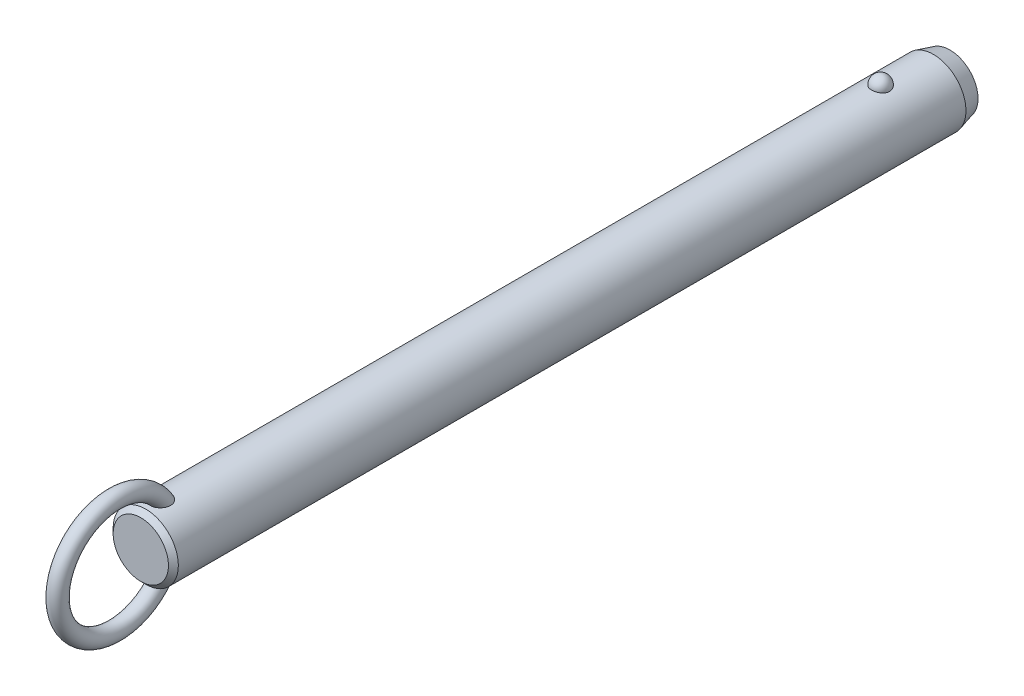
ISO-10303-21;
HEADER;
FILE_DESCRIPTION(('STEP AP214'),'2;1');
FILE_NAME('part.step','',(''),(''),'','','');
FILE_SCHEMA(('AUTOMOTIVE_DESIGN { 1 0 10303 214 1 1 1 1 }'));
ENDSEC;
DATA;
#1=APPLICATION_CONTEXT('core data for automotive mechanical design processes');
#2=APPLICATION_PROTOCOL_DEFINITION('international standard','automotive_design',2000,#1);
#3=PRODUCT_CONTEXT('',#1,'mechanical');
#4=PRODUCT('Part','Part','',(#3));
#5=PRODUCT_RELATED_PRODUCT_CATEGORY('part','',(#4));
#6=PRODUCT_DEFINITION_FORMATION('','',#4);
#7=PRODUCT_DEFINITION_CONTEXT('part definition',#1,'design');
#8=PRODUCT_DEFINITION('design','',#6,#7);
#9=PRODUCT_DEFINITION_SHAPE('','',#8);
#10=(LENGTH_UNIT() NAMED_UNIT(*) SI_UNIT(.MILLI.,.METRE.));
#11=(NAMED_UNIT(*) PLANE_ANGLE_UNIT() SI_UNIT($,.RADIAN.));
#12=(NAMED_UNIT(*) SI_UNIT($,.STERADIAN.) SOLID_ANGLE_UNIT());
#13=UNCERTAINTY_MEASURE_WITH_UNIT(LENGTH_MEASURE(1.E-05),#10,'distance_accuracy_value','');
#14=(GEOMETRIC_REPRESENTATION_CONTEXT(3) GLOBAL_UNCERTAINTY_ASSIGNED_CONTEXT((#13)) GLOBAL_UNIT_ASSIGNED_CONTEXT((#10,
#11,#12)) REPRESENTATION_CONTEXT('',''));
#15=CARTESIAN_POINT('',(0.,0.,0.));
#16=DIRECTION('',(0.,0.,1.));
#17=DIRECTION('',(1.,0.,0.));
#18=AXIS2_PLACEMENT_3D('',#15,#16,#17);
#19=CARTESIAN_POINT('',(0.,0.,167.6));
#20=DIRECTION('',(0.,0.,-1.));
#21=DIRECTION('',(-1.,0.,0.));
#22=AXIS2_PLACEMENT_3D('',#19,#20,#21);
#23=CYLINDRICAL_SURFACE('',#22,7.9);
#24=CARTESIAN_POINT('',(2.1785689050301,7.59367088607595,-2.20000000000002));
#25=CARTESIAN_POINT('',(2.17856679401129,7.59367269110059,-2.07701843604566));
#26=CARTESIAN_POINT('',(2.16853481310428,7.59657145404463,-1.95401006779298));
#27=CARTESIAN_POINT('',(2.12864689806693,7.607843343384,-1.71147811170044));
#28=CARTESIAN_POINT('',(2.09878338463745,7.61621856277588,-1.5919558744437));
#29=CARTESIAN_POINT('',(2.0199931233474,7.63749180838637,-1.35985638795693));
#30=CARTESIAN_POINT('',(1.97107475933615,7.6503878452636,-1.24727610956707));
#31=CARTESIAN_POINT('',(1.85539377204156,7.67926115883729,-1.03213234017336));
#32=CARTESIAN_POINT('',(1.78863158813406,7.69523835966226,-0.929568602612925));
#33=CARTESIAN_POINT('',(1.63856494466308,7.7285848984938,-0.73678633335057));
#34=CARTESIAN_POINT('',(1.55518140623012,7.7459606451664,-0.646630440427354));
#35=CARTESIAN_POINT('',(1.37422937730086,7.78009978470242,-0.481747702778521));
#36=CARTESIAN_POINT('',(1.27666086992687,7.79686317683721,-0.407020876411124));
#37=CARTESIAN_POINT('',(1.07024728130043,7.82786153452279,-0.275278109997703));
#38=CARTESIAN_POINT('',(0.961434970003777,7.84210353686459,-0.218212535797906));
#39=CARTESIAN_POINT('',(0.735351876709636,7.86652194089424,-0.123146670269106));
#40=CARTESIAN_POINT('',(0.618082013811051,7.87669878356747,-0.0851443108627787));
#41=CARTESIAN_POINT('',(0.380637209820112,7.89170521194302,-0.0298158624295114));
#42=CARTESIAN_POINT('',(0.260550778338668,7.89662650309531,-0.0121347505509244));
#43=CARTESIAN_POINT('',(0.0190117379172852,7.90090003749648,0.00324379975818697));
#44=CARTESIAN_POINT('',(-0.102440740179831,7.90025280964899,0.000943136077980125));
#45=CARTESIAN_POINT('',(-0.341452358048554,7.89351056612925,-0.0233955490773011));
#46=CARTESIAN_POINT('',(-0.459042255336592,7.88749257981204,-0.0451545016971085));
#47=CARTESIAN_POINT('',(-0.688796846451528,7.87075812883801,-0.107408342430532));
#48=CARTESIAN_POINT('',(-0.800961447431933,7.86004158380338,-0.14790355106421));
#49=CARTESIAN_POINT('',(-1.01743634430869,7.83497131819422,-0.246799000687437));
#50=CARTESIAN_POINT('',(-1.12169791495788,7.82059709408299,-0.305300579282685));
#51=CARTESIAN_POINT('',(-1.31891765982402,7.78976470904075,-0.43854939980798));
#52=CARTESIAN_POINT('',(-1.41187469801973,7.77330633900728,-0.513298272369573));
#53=CARTESIAN_POINT('',(-1.58577142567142,7.73972434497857,-0.678622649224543));
#54=CARTESIAN_POINT('',(-1.66645140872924,7.72259402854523,-0.769470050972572));
#55=CARTESIAN_POINT('',(-1.81161503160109,7.68983776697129,-0.963538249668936));
#56=CARTESIAN_POINT('',(-1.87609753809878,7.6742119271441,-1.0667599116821));
#57=CARTESIAN_POINT('',(-1.98790138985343,7.6460202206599,-1.28401170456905));
#58=CARTESIAN_POINT('',(-2.03501994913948,7.63349104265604,-1.39815107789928));
#59=CARTESIAN_POINT('',(-2.10986724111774,7.6131449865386,-1.6330178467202));
#60=CARTESIAN_POINT('',(-2.1375965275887,7.60532797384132,-1.75374505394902));
#61=CARTESIAN_POINT('',(-2.17289256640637,7.5953195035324,-1.99782562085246));
#62=CARTESIAN_POINT('',(-2.18054294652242,7.59310471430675,-2.12116592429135));
#63=CARTESIAN_POINT('',(-2.17572919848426,7.59448538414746,-2.36741799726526));
#64=CARTESIAN_POINT('',(-2.1632656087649,7.59808068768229,-2.49032977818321));
#65=CARTESIAN_POINT('',(-2.11865035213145,7.61064035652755,-2.73161015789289));
#66=CARTESIAN_POINT('',(-2.08659579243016,7.61957823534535,-2.84999812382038));
#67=CARTESIAN_POINT('',(-2.00367799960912,7.64179982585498,-3.07955956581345));
#68=CARTESIAN_POINT('',(-1.9528140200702,7.65508371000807,-3.19073275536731));
#69=CARTESIAN_POINT('',(-1.83321113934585,7.68460381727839,-3.40337899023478));
#70=CARTESIAN_POINT('',(-1.76437735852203,7.70085556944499,-3.5047965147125));
#71=CARTESIAN_POINT('',(-1.61069526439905,7.73445734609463,-3.69446912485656));
#72=CARTESIAN_POINT('',(-1.52584634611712,7.75180741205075,-3.78272371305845));
#73=CARTESIAN_POINT('',(-1.34198059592,7.78574608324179,-3.94393987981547));
#74=CARTESIAN_POINT('',(-1.24291308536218,7.80233167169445,-4.01684434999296));
#75=CARTESIAN_POINT('',(-1.03352039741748,7.83281625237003,-4.14489386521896));
#76=CARTESIAN_POINT('',(-0.92319600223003,7.84671543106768,-4.20004014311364));
#77=CARTESIAN_POINT('',(-0.695822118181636,7.87011575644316,-4.29042017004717));
#78=CARTESIAN_POINT('',(-0.578872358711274,7.87966903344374,-4.32589112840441));
#79=CARTESIAN_POINT('',(-0.340410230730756,7.8935652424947,-4.37692226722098));
#80=CARTESIAN_POINT('',(-0.218898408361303,7.89790879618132,-4.39248482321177));
#81=CARTESIAN_POINT('',(0.0228107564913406,7.90087453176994,-4.40314405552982));
#82=CARTESIAN_POINT('',(0.142990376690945,7.89960185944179,-4.39861683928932));
#83=CARTESIAN_POINT('',(0.380829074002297,7.89171262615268,-4.37008293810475));
#84=CARTESIAN_POINT('',(0.498488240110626,7.8850962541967,-4.34607694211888));
#85=CARTESIAN_POINT('',(0.727535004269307,7.86726442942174,-4.27939317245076));
#86=CARTESIAN_POINT('',(0.838944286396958,7.85606616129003,-4.23678512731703));
#87=CARTESIAN_POINT('',(1.05295421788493,7.83025654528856,-4.13408348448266));
#88=CARTESIAN_POINT('',(1.15555431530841,7.81564498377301,-4.07398879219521));
#89=CARTESIAN_POINT('',(1.35076763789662,7.7843022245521,-3.93687432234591));
#90=CARTESIAN_POINT('',(1.4432046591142,7.76754209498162,-3.85961036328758));
#91=CARTESIAN_POINT('',(1.6139111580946,7.73387857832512,-3.69076949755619));
#92=CARTESIAN_POINT('',(1.6921781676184,7.71697516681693,-3.59919010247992));
#93=CARTESIAN_POINT('',(1.83380875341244,7.6845643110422,-3.40247278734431));
#94=CARTESIAN_POINT('',(1.89689280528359,7.66908588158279,-3.29712873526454));
#95=CARTESIAN_POINT('',(2.0047823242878,7.64159441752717,-3.07707931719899));
#96=CARTESIAN_POINT('',(2.0495945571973,7.62958010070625,-2.96237743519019));
#97=CARTESIAN_POINT('',(2.11580183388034,7.61146617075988,-2.74040519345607));
#98=CARTESIAN_POINT('',(2.13929812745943,7.60484503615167,-2.63379846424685));
#99=CARTESIAN_POINT('',(2.17068242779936,7.59594664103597,-2.4181348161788));
#100=CARTESIAN_POINT('',(2.17857077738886,7.59366928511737,-2.30907795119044));
#101=CARTESIAN_POINT('',(2.1785689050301,7.59367088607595,-2.20000000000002));
#102=B_SPLINE_CURVE_WITH_KNOTS('',3,(#24,#25,#26,#27,#28,#29,#30,#31,#32,#33,#34,#35,#36,#37,
#38,#39,#40,#41,#42,#43,#44,#45,#46,#47,#48,#49,#50,#51,#52,#53,#54,#55,#56,#57,#58,#59,#60,#61,
#62,#63,#64,#65,#66,#67,#68,#69,#70,#71,#72,#73,#74,#75,#76,#77,#78,#79,#80,#81,#82,#83,#84,#85,
#86,#87,#88,#89,#90,#91,#92,#93,#94,#95,#96,#97,#98,#99,#100,#101),.UNSPECIFIED.,.T.,.F.,(4,2,2,
2,2,2,2,2,2,2,2,2,2,2,2,2,2,2,2,2,2,2,2,2,2,2,2,2,2,2,2,2,2,2,2,2,2,2,4),(0.,0.368552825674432,
0.737246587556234,1.10577831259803,1.4743009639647,1.8446206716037,2.21494081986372,
2.5842105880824,2.95344028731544,3.31611630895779,3.67875788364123,4.03628044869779,
4.39380913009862,4.75338791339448,5.11300280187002,5.47939989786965,5.8458226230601,
6.21639834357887,6.58696347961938,6.95598276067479,7.32499216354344,7.69218715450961,
8.0593967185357,8.42858578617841,8.79778880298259,9.16834203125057,9.5388695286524,
9.90482699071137,10.2707407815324,10.6298333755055,10.9889132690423,11.3466585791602,
11.7044262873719,12.0676511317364,12.4309391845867,12.8004764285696,13.1698767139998,
13.4967701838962,13.8236564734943),.UNSPECIFIED.);
#103=CARTESIAN_POINT('',(2.1785689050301,7.59367088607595,-2.20000000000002));
#104=VERTEX_POINT('',#103);
#105=EDGE_CURVE('E41',#104,#104,#102,.T.);
#106=ORIENTED_EDGE('',*,*,#105,.T.);
#107=EDGE_LOOP('',(#106));
#108=FACE_BOUND('',#107,.T.);
#109=CARTESIAN_POINT('',(0.,0.,175.92));
#110=DIRECTION('',(0.,0.,1.));
#111=DIRECTION('',(1.,0.,0.));
#112=AXIS2_PLACEMENT_3D('',#109,#110,#111);
#113=CIRCLE('',#112,7.9);
#114=CARTESIAN_POINT('',(7.9,0.,175.92));
#115=VERTEX_POINT('',#114);
#116=EDGE_CURVE('E10',#115,#115,#113,.F.);
#117=ORIENTED_EDGE('',*,*,#116,.T.);
#118=EDGE_LOOP('',(#117));
#119=FACE_BOUND('',#118,.T.);
#120=CARTESIAN_POINT('',(-0.630969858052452,-7.87476203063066,169.812432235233));
#121=CARTESIAN_POINT('',(-0.734180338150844,-7.86648998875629,169.847285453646));
#122=CARTESIAN_POINT('',(-0.834476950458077,-7.85639291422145,169.890816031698));
#123=CARTESIAN_POINT('',(-1.0262035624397,-7.83366343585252,169.994094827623));
#124=CARTESIAN_POINT('',(-1.1176141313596,-7.82102565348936,170.053877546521));
#125=CARTESIAN_POINT('',(-1.28877277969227,-7.79464922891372,170.187839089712));
#126=CARTESIAN_POINT('',(-1.36854014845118,-7.78091246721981,170.261993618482));
#127=CARTESIAN_POINT('',(-1.51461521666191,-7.75380398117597,170.422494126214));
#128=CARTESIAN_POINT('',(-1.58092966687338,-7.74043207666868,170.508833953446));
#129=CARTESIAN_POINT('',(-1.70019064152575,-7.7151252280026,170.692978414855));
#130=CARTESIAN_POINT('',(-1.75284037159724,-7.70322473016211,170.790979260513));
#131=CARTESIAN_POINT('',(-1.84263464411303,-7.68224112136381,170.994102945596));
#132=CARTESIAN_POINT('',(-1.87977299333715,-7.6731591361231,171.099228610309));
#133=CARTESIAN_POINT('',(-1.94152728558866,-7.65777930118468,171.323284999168));
#134=CARTESIAN_POINT('',(-1.96475471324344,-7.65179654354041,171.442616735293));
#135=CARTESIAN_POINT('',(-1.99449499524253,-7.64409642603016,171.68342986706));
#136=CARTESIAN_POINT('',(-2.0010005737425,-7.64238092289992,171.804912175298));
#137=CARTESIAN_POINT('',(-1.99856014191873,-7.64302120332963,172.068340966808));
#138=CARTESIAN_POINT('',(-1.98680021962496,-7.64611845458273,172.21025654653));
#139=CARTESIAN_POINT('',(-1.94457772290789,-7.65696186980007,172.491118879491));
#140=CARTESIAN_POINT('',(-1.91409393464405,-7.66471330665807,172.630062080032));
#141=CARTESIAN_POINT('',(-1.82768670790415,-7.68582947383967,172.931939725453));
#142=CARTESIAN_POINT('',(-1.76772963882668,-7.70003779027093,173.093686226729));
#143=CARTESIAN_POINT('',(-1.65998501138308,-7.72371550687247,173.327695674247));
#144=CARTESIAN_POINT('',(-1.62107967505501,-7.73200670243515,173.404297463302));
#145=CARTESIAN_POINT('',(-1.53727726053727,-7.74910377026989,173.554079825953));
#146=CARTESIAN_POINT('',(-1.49238215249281,-7.75790947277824,173.627261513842));
#147=CARTESIAN_POINT('',(-1.37397050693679,-7.77993338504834,173.80288382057));
#148=CARTESIAN_POINT('',(-1.29690364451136,-7.79328473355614,173.902955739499));
#149=CARTESIAN_POINT('',(-1.1288548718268,-7.81939266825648,174.090714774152));
#150=CARTESIAN_POINT('',(-1.0378992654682,-7.83215032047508,174.178424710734));
#151=CARTESIAN_POINT('',(-0.86953281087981,-7.85231710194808,174.313414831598));
#152=CARTESIAN_POINT('',(-0.795716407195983,-7.86021093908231,174.365076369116));
#153=CARTESIAN_POINT('',(-0.640813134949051,-7.87434920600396,174.456381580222));
#154=CARTESIAN_POINT('',(-0.559737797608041,-7.88059619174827,174.49604389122));
#155=CARTESIAN_POINT('',(-0.406456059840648,-7.88984116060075,174.554300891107));
#156=CARTESIAN_POINT('',(-0.335227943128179,-7.89321892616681,174.575384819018));
#157=CARTESIAN_POINT('',(-0.190193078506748,-7.89804235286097,174.60541418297));
#158=CARTESIAN_POINT('',(-0.11638863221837,-7.89948969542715,174.614370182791));
#159=CARTESIAN_POINT('',(0.0318414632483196,-7.90028409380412,174.619291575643));
#160=CARTESIAN_POINT('',(0.106268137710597,-7.89962640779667,174.615227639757));
#161=CARTESIAN_POINT('',(0.253290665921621,-7.8962818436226,174.594461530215));
#162=CARTESIAN_POINT('',(0.325885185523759,-7.8935935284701,174.577750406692));
#163=CARTESIAN_POINT('',(0.481441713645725,-7.88577340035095,174.528738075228));
#164=CARTESIAN_POINT('',(0.563611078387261,-7.88026321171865,174.494005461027));
#165=CARTESIAN_POINT('',(0.721129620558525,-7.86741729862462,174.411796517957));
#166=CARTESIAN_POINT('',(0.796466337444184,-7.86007832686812,174.364297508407));
#167=CARTESIAN_POINT('',(0.971456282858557,-7.84073285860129,174.236513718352));
#168=CARTESIAN_POINT('',(1.06719686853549,-7.82809461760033,174.151004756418));
#169=CARTESIAN_POINT('',(1.24418921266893,-7.80192439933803,173.966232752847));
#170=CARTESIAN_POINT('',(1.32540832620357,-7.78839049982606,173.866939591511));
#171=CARTESIAN_POINT('',(1.45199971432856,-7.76559693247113,173.689576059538));
#172=CARTESIAN_POINT('',(1.50085649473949,-7.75626094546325,173.613954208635));
#173=CARTESIAN_POINT('',(1.59197749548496,-7.7380727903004,173.458742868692));
#174=CARTESIAN_POINT('',(1.63423919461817,-7.72922080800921,173.379151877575));
#175=CARTESIAN_POINT('',(1.71222612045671,-7.71231959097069,173.216664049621));
#176=CARTESIAN_POINT('',(1.74794516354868,-7.70427111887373,173.133764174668));
#177=CARTESIAN_POINT('',(1.81270113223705,-7.68929240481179,172.965296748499));
#178=CARTESIAN_POINT('',(1.84173789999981,-7.68236218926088,172.879729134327));
#179=CARTESIAN_POINT('',(1.89322698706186,-7.6698375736,172.70528702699));
#180=CARTESIAN_POINT('',(1.91558744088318,-7.66426199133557,172.616383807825));
#181=CARTESIAN_POINT('',(1.95281367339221,-7.65485915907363,172.436969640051));
#182=CARTESIAN_POINT('',(1.96767946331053,-7.65103190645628,172.346458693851));
#183=CARTESIAN_POINT('',(2.00021456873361,-7.64262981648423,172.073732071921));
#184=CARTESIAN_POINT('',(2.00600691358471,-7.6410871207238,171.889709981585));
#185=CARTESIAN_POINT('',(1.98445334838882,-7.64669564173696,171.576501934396));
#186=CARTESIAN_POINT('',(1.96607186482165,-7.65149688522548,171.446618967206));
#187=CARTESIAN_POINT('',(1.90884967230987,-7.6659762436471,171.191632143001));
#188=CARTESIAN_POINT('',(1.87002101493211,-7.67565148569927,171.066525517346));
#189=CARTESIAN_POINT('',(1.77063986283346,-7.69918471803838,170.82454013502));
#190=CARTESIAN_POINT('',(1.70993724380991,-7.71307150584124,170.707725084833));
#191=CARTESIAN_POINT('',(1.56733070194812,-7.74330306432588,170.488144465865));
#192=CARTESIAN_POINT('',(1.48543692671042,-7.75964665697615,170.385372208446));
#193=CARTESIAN_POINT('',(1.31346177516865,-7.79047523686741,170.209380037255));
#194=CARTESIAN_POINT('',(1.22547278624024,-7.80495298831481,170.134106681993));
#195=CARTESIAN_POINT('',(1.03724352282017,-7.83218597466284,170.000486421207));
#196=CARTESIAN_POINT('',(0.937008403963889,-7.84494192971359,169.942132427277));
#197=CARTESIAN_POINT('',(0.73359933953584,-7.86649045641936,169.847027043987));
#198=CARTESIAN_POINT('',(0.63094101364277,-7.87547134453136,169.809210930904));
#199=CARTESIAN_POINT('',(0.420465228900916,-7.88950708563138,169.751116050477));
#200=CARTESIAN_POINT('',(0.31264590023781,-7.89456050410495,169.73084369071));
#201=CARTESIAN_POINT('',(0.0960869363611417,-7.9001518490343,169.708455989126));
#202=CARTESIAN_POINT('',(-0.012634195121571,-7.90073226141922,169.706169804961));
#203=CARTESIAN_POINT('',(-0.228766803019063,-7.89742350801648,169.719367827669));
#204=CARTESIAN_POINT('',(-0.336180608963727,-7.89354403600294,169.734813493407));
#205=CARTESIAN_POINT('',(-0.473410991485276,-7.88586871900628,169.766217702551));
#206=CARTESIAN_POINT('',(-0.505257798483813,-7.88388984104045,169.774354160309));
#207=CARTESIAN_POINT('',(-0.568481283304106,-7.87958326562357,169.792208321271));
#208=CARTESIAN_POINT('',(-0.599857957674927,-7.87725556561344,169.801926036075));
#209=CARTESIAN_POINT('',(-0.630969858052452,-7.87476203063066,169.812432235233));
#210=B_SPLINE_CURVE_WITH_KNOTS('',3,(#120,#121,#122,#123,#124,#125,#126,#127,#128,#129,#130,
#131,#132,#133,#134,#135,#136,#137,#138,#139,#140,#141,#142,#143,#144,#145,#146,#147,#148,#149,
#150,#151,#152,#153,#154,#155,#156,#157,#158,#159,#160,#161,#162,#163,#164,#165,#166,#167,#168,
#169,#170,#171,#172,#173,#174,#175,#176,#177,#178,#179,#180,#181,#182,#183,#184,#185,#186,#187,
#188,#189,#190,#191,#192,#193,#194,#195,#196,#197,#198,#199,#200,#201,#202,#203,#204,#205,#206,
#207,#208,#209),.UNSPECIFIED.,.T.,.F.,(4,2,2,2,2,2,2,2,2,2,2,2,2,2,2,2,2,2,2,2,2,2,2,2,2,2,2,2,
2,2,2,2,2,2,2,2,2,2,2,2,2,2,2,2,4),(0.,0.327622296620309,0.655945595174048,0.983718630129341,
1.3113267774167,1.64554655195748,1.97989964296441,2.34365728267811,2.70757317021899,
3.13333684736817,3.55958380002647,4.07655306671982,4.33527897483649,4.59391999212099,
4.97382437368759,5.353017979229,5.62348245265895,5.89352465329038,6.11565959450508,
6.33760092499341,6.56004255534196,6.78264174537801,7.0493084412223,7.31645206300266,
7.70130871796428,8.08701995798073,8.35824509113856,8.62957365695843,8.90115735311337,
9.1727474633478,9.44791855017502,9.72308922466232,10.2715298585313,10.6638393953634,
11.0559179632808,11.4507403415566,11.8453740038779,12.1936425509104,12.5417649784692,
12.8695063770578,13.1973674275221,13.5221104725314,13.8461490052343,13.9449071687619,
14.0436660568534),.UNSPECIFIED.);
#211=CARTESIAN_POINT('',(-0.630969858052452,-7.87476203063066,169.812432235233));
#212=VERTEX_POINT('',#211);
#213=EDGE_CURVE('E60',#212,#212,#210,.T.);
#214=ORIENTED_EDGE('',*,*,#213,.T.);
#215=EDGE_LOOP('',(#214));
#216=FACE_BOUND('',#215,.T.);
#217=CARTESIAN_POINT('',(-0.630969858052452,7.87476203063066,169.812432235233));
#218=CARTESIAN_POINT('',(-0.52891882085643,7.88293636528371,169.777979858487));
#219=CARTESIAN_POINT('',(-0.423745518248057,7.88934810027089,169.751915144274));
#220=CARTESIAN_POINT('',(-0.210236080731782,7.8979273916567,169.717282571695));
#221=CARTESIAN_POINT('',(-0.101893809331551,7.90008607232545,169.708751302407));
#222=CARTESIAN_POINT('',(0.11466056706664,7.89990877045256,169.709457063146));
#223=CARTESIAN_POINT('',(0.222872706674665,7.89757640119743,169.71867980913));
#224=CARTESIAN_POINT('',(0.436107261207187,7.88867538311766,169.754652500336));
#225=CARTESIAN_POINT('',(0.541131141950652,7.8821087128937,169.78139425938));
#226=CARTESIAN_POINT('',(0.745085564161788,7.86545130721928,169.851756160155));
#227=CARTESIAN_POINT('',(0.844015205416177,7.85536005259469,169.895378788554));
#228=CARTESIAN_POINT('',(1.03299167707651,7.83275153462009,169.998379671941));
#229=CARTESIAN_POINT('',(1.12303841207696,7.8202342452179,170.057758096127));
#230=CARTESIAN_POINT('',(1.29214734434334,7.79408219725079,170.190864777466));
#231=CARTESIAN_POINT('',(1.37116907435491,7.78044359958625,170.264643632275));
#232=CARTESIAN_POINT('',(1.51597677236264,7.75353170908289,170.424235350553));
#233=CARTESIAN_POINT('',(1.58176261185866,7.74025841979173,170.510048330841));
#234=CARTESIAN_POINT('',(1.70057386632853,7.71504069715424,170.693644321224));
#235=CARTESIAN_POINT('',(1.75320073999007,7.7031425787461,170.791690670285));
#236=CARTESIAN_POINT('',(1.8429376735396,7.68216822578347,170.994893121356));
#237=CARTESIAN_POINT('',(1.88004278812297,7.67309289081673,171.100051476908));
#238=CARTESIAN_POINT('',(1.9417232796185,7.6577294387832,171.324167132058));
#239=CARTESIAN_POINT('',(1.96491037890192,7.65175648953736,171.443524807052));
#240=CARTESIAN_POINT('',(1.9945689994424,7.64407702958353,171.684384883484));
#241=CARTESIAN_POINT('',(2.00103304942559,7.64237242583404,171.80588821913));
#242=CARTESIAN_POINT('',(1.99850166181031,7.64303650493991,172.069368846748));
#243=CARTESIAN_POINT('',(1.98669038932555,7.64614714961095,172.211314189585));
#244=CARTESIAN_POINT('',(1.94436120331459,7.6570170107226,172.492228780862));
#245=CARTESIAN_POINT('',(1.91382203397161,7.66478150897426,172.631194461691));
#246=CARTESIAN_POINT('',(1.82728754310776,7.68592483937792,172.933111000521));
#247=CARTESIAN_POINT('',(1.76725778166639,7.7001468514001,173.094872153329));
#248=CARTESIAN_POINT('',(1.65939700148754,7.72384204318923,173.328891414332));
#249=CARTESIAN_POINT('',(1.62045187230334,7.73213852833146,173.405494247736));
#250=CARTESIAN_POINT('',(1.53656684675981,7.74924489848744,173.555273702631));
#251=CARTESIAN_POINT('',(1.49162892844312,7.75805461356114,173.628451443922));
#252=CARTESIAN_POINT('',(1.37317698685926,7.78007342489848,173.803952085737));
#253=CARTESIAN_POINT('',(1.29612360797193,7.79341423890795,173.903911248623));
#254=CARTESIAN_POINT('',(1.12812043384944,7.81949839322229,174.09145083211));
#255=CARTESIAN_POINT('',(1.03719688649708,7.83224280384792,174.179054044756));
#256=CARTESIAN_POINT('',(0.868871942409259,7.85239026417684,174.31389715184));
#257=CARTESIAN_POINT('',(0.795056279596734,7.86027769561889,174.365511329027));
#258=CARTESIAN_POINT('',(0.640160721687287,7.87440222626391,174.456720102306));
#259=CARTESIAN_POINT('',(0.559092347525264,7.88064188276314,174.496333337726));
#260=CARTESIAN_POINT('',(0.405820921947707,7.8898738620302,174.554505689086));
#261=CARTESIAN_POINT('',(0.334594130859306,7.89324577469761,174.575552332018));
#262=CARTESIAN_POINT('',(0.189568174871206,7.89805733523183,174.605507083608));
#263=CARTESIAN_POINT('',(0.115771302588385,7.89949866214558,174.614425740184));
#264=CARTESIAN_POINT('',(-0.0324359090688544,7.90028156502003,174.61927589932));
#265=CARTESIAN_POINT('',(-0.106847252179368,7.89961843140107,174.615178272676));
#266=CARTESIAN_POINT('',(-0.253834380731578,7.8962642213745,174.594351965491));
#267=CARTESIAN_POINT('',(-0.326408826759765,7.89357170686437,174.577614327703));
#268=CARTESIAN_POINT('',(-0.481962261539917,7.88574179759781,174.528539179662));
#269=CARTESIAN_POINT('',(-0.564145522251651,7.88022507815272,174.493763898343));
#270=CARTESIAN_POINT('',(-0.7216852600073,7.86736646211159,174.411468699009));
#271=CARTESIAN_POINT('',(-0.797029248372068,7.8600213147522,174.363926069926));
#272=CARTESIAN_POINT('',(-0.972044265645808,7.84066026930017,174.236026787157));
#273=CARTESIAN_POINT('',(-1.06779803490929,7.828012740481,174.150443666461));
#274=CARTESIAN_POINT('',(-1.24480531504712,7.80182621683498,173.965522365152));
#275=CARTESIAN_POINT('',(-1.32602618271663,7.78828530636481,173.866154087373));
#276=CARTESIAN_POINT('',(-1.4525983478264,7.76548487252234,173.688680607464));
#277=CARTESIAN_POINT('',(-1.50143856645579,7.75614818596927,173.613025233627));
#278=CARTESIAN_POINT('',(-1.59252410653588,7.73796020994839,173.457748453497));
#279=CARTESIAN_POINT('',(-1.63476690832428,7.729109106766,173.378125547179));
#280=CARTESIAN_POINT('',(-1.71271318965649,7.71221133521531,173.215575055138));
#281=CARTESIAN_POINT('',(-1.74841047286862,7.70416543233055,173.132644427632));
#282=CARTESIAN_POINT('',(-1.81311929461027,7.6891937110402,172.964116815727));
#283=CARTESIAN_POINT('',(-1.84213067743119,7.68226791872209,172.878519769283));
#284=CARTESIAN_POINT('',(-1.89356259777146,7.66975461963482,172.704025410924));
#285=CARTESIAN_POINT('',(-1.91589165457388,7.66418586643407,172.615099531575));
#286=CARTESIAN_POINT('',(-1.9530507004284,7.65479859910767,172.435642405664));
#287=CARTESIAN_POINT('',(-1.96788069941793,7.65098008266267,172.345111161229));
#288=CARTESIAN_POINT('',(-2.00030078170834,7.64260704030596,172.072327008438));
#289=CARTESIAN_POINT('',(-2.00600576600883,7.64108760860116,171.888271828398));
#290=CARTESIAN_POINT('',(-1.9842848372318,7.64673945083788,171.575080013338));
#291=CARTESIAN_POINT('',(-1.96583698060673,7.65155751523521,171.445240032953));
#292=CARTESIAN_POINT('',(-1.90848948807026,7.66606613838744,171.190361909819));
#293=CARTESIAN_POINT('',(-1.86960376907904,7.67575338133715,171.065320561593));
#294=CARTESIAN_POINT('',(-1.77013421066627,7.6993013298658,170.823500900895));
#295=CARTESIAN_POINT('',(-1.70940488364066,7.71318991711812,170.706784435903));
#296=CARTESIAN_POINT('',(-1.5667295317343,7.74342495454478,170.487340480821));
#297=CARTESIAN_POINT('',(-1.48478316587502,7.75977144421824,170.38461321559));
#298=CARTESIAN_POINT('',(-1.31266325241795,7.79061163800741,170.208643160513));
#299=CARTESIAN_POINT('',(-1.22456383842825,7.80509908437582,170.133358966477));
#300=CARTESIAN_POINT('',(-1.03622400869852,7.83231881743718,169.999865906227));
#301=CARTESIAN_POINT('',(-0.936015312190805,7.84505551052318,169.941613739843));
#302=CARTESIAN_POINT('',(-0.798824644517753,7.85957802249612,169.877540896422));
#303=CARTESIAN_POINT('',(-0.765787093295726,7.86286821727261,169.863224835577));
#304=CARTESIAN_POINT('',(-0.698939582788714,7.86909211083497,169.836436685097));
#305=CARTESIAN_POINT('',(-0.665129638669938,7.8720258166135,169.823964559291));
#306=CARTESIAN_POINT('',(-0.630969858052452,7.87476203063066,169.812432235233));
#307=B_SPLINE_CURVE_WITH_KNOTS('',3,(#217,#218,#219,#220,#221,#222,#223,#224,#225,#226,#227,
#228,#229,#230,#231,#232,#233,#234,#235,#236,#237,#238,#239,#240,#241,#242,#243,#244,#245,#246,
#247,#248,#249,#250,#251,#252,#253,#254,#255,#256,#257,#258,#259,#260,#261,#262,#263,#264,#265,
#266,#267,#268,#269,#270,#271,#272,#273,#274,#275,#276,#277,#278,#279,#280,#281,#282,#283,#284,
#285,#286,#287,#288,#289,#290,#291,#292,#293,#294,#295,#296,#297,#298,#299,#300,#301,#302,#303,
#304,#305,#306),.UNSPECIFIED.,.T.,.F.,(4,2,2,2,2,2,2,2,2,2,2,2,2,2,2,2,2,2,2,2,2,2,2,2,2,2,2,2,
2,2,2,2,2,2,2,2,2,2,2,2,2,2,2,2,4),(0.,0.32392037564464,0.648516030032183,0.972850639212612,
1.29703380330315,1.62126473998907,1.94549915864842,2.27089401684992,2.59629203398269,
2.93059633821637,3.26500707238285,3.62881644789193,3.99278833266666,4.4186542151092,
4.84500434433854,5.36209210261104,5.62087589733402,5.87957448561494,6.25918598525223,
6.63808782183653,6.90846748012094,7.17842501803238,7.40052350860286,7.62242871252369,
7.84483086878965,8.0673907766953,8.33414615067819,8.60137921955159,8.98641454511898,
9.37230415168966,9.64358673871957,9.91497268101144,10.1866142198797,10.4582620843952,
10.7334745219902,11.008686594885,11.5572126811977,11.9494246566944,12.3413699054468,
12.7359755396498,13.1305875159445,13.4791770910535,13.82687259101,13.9353013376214,
14.0437279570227),.UNSPECIFIED.);
#308=CARTESIAN_POINT('',(-0.630969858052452,7.87476203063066,169.812432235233));
#309=VERTEX_POINT('',#308);
#310=EDGE_CURVE('E68',#309,#309,#307,.T.);
#311=ORIENTED_EDGE('',*,*,#310,.T.);
#312=EDGE_LOOP('',(#311));
#313=FACE_BOUND('',#312,.T.);
#314=CARTESIAN_POINT('',(0.,0.,-15.));
#315=DIRECTION('',(0.,0.,-1.));
#316=DIRECTION('',(-1.,0.,0.));
#317=AXIS2_PLACEMENT_3D('',#314,#315,#316);
#318=CIRCLE('',#317,7.9);
#319=CARTESIAN_POINT('',(-7.9,0.,-15.));
#320=VERTEX_POINT('',#319);
#321=EDGE_CURVE('E57',#320,#320,#318,.F.);
#322=ORIENTED_EDGE('',*,*,#321,.T.);
#323=EDGE_LOOP('',(#322));
#324=FACE_BOUND('',#323,.T.);
#325=ADVANCED_FACE('F37',(#108,#119,#216,#313,#324),#23,.T.);
#326=CARTESIAN_POINT('',(0.,0.,-19.));
#327=DIRECTION('',(0.,0.,-1.));
#328=DIRECTION('',(-1.,0.,0.));
#329=AXIS2_PLACEMENT_3D('',#326,#327,#328);
#330=PLANE('',#329);
#331=CARTESIAN_POINT('',(0.,0.,-19.));
#332=DIRECTION('',(0.,0.,-1.));
#333=DIRECTION('',(-1.,0.,0.));
#334=AXIS2_PLACEMENT_3D('',#331,#332,#333);
#335=CIRCLE('',#334,6.8282032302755);
#336=CARTESIAN_POINT('',(-6.8282032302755,0.,-19.));
#337=VERTEX_POINT('',#336);
#338=EDGE_CURVE('E67',#337,#337,#335,.T.);
#339=ORIENTED_EDGE('',*,*,#338,.T.);
#340=EDGE_LOOP('',(#339));
#341=FACE_BOUND('',#340,.T.);
#342=ADVANCED_FACE('F86',(#341),#330,.T.);
#343=CARTESIAN_POINT('',(0.,0.,-19.));
#344=DIRECTION('',(0.,0.,1.));
#345=DIRECTION('',(1.,0.,0.));
#346=AXIS2_PLACEMENT_3D('',#343,#344,#345);
#347=CONICAL_SURFACE('',#346,6.8282032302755,0.261799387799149);
#348=ORIENTED_EDGE('',*,*,#321,.F.);
#349=EDGE_LOOP('',(#348));
#350=FACE_BOUND('',#349,.T.);
#351=ORIENTED_EDGE('',*,*,#338,.F.);
#352=EDGE_LOOP('',(#351));
#353=FACE_BOUND('',#352,.T.);
#354=ADVANCED_FACE('F84',(#350,#353),#347,.T.);
#355=CARTESIAN_POINT('',(0.,0.,177.12));
#356=DIRECTION('',(0.,0.,1.));
#357=DIRECTION('',(1.,0.,0.));
#358=AXIS2_PLACEMENT_3D('',#355,#356,#357);
#359=PLANE('',#358);
#360=CARTESIAN_POINT('',(0.,0.,177.12));
#361=DIRECTION('',(0.,0.,1.));
#362=DIRECTION('',(1.,0.,0.));
#363=AXIS2_PLACEMENT_3D('',#360,#361,#362);
#364=CIRCLE('',#363,6.70000000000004);
#365=CARTESIAN_POINT('',(6.70000000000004,0.,177.12));
#366=VERTEX_POINT('',#365);
#367=EDGE_CURVE('E50',#366,#366,#364,.T.);
#368=ORIENTED_EDGE('',*,*,#367,.T.);
#369=EDGE_LOOP('',(#368));
#370=FACE_BOUND('',#369,.T.);
#371=ADVANCED_FACE('F78',(#370),#359,.T.);
#372=CARTESIAN_POINT('',(0.,0.,183.45));
#373=DIRECTION('',(1.,0.,0.));
#374=DIRECTION('',(0.,0.,-1.));
#375=AXIS2_PLACEMENT_3D('',#372,#373,#374);
#376=TOROIDAL_SURFACE('',#375,13.85,2.);
#377=ORIENTED_EDGE('',*,*,#310,.F.);
#378=EDGE_LOOP('',(#377));
#379=FACE_BOUND('',#378,.T.);
#380=ORIENTED_EDGE('',*,*,#213,.F.);
#381=EDGE_LOOP('',(#380));
#382=FACE_BOUND('',#381,.T.);
#383=ADVANCED_FACE('F74',(#379,#382),#376,.T.);
#384=CARTESIAN_POINT('',(0.,0.,177.12));
#385=DIRECTION('',(0.,0.,-1.));
#386=DIRECTION('',(-1.,0.,0.));
#387=AXIS2_PLACEMENT_3D('',#384,#385,#386);
#388=CONICAL_SURFACE('',#387,6.70000000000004,0.785398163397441);
#389=ORIENTED_EDGE('',*,*,#116,.F.);
#390=EDGE_LOOP('',(#389));
#391=FACE_BOUND('',#390,.T.);
#392=ORIENTED_EDGE('',*,*,#367,.F.);
#393=EDGE_LOOP('',(#392));
#394=FACE_BOUND('',#393,.T.);
#395=ADVANCED_FACE('F39',(#391,#394),#388,.T.);
#396=CARTESIAN_POINT('',(0.,7.9,-2.20000000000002));
#397=DIRECTION('',(0.,1.,0.));
#398=DIRECTION('',(0.,0.,-1.));
#399=AXIS2_PLACEMENT_3D('',#396,#397,#398);
#400=SPHERICAL_SURFACE('',#399,2.2);
#401=ORIENTED_EDGE('',*,*,#105,.F.);
#402=EDGE_LOOP('',(#401));
#403=FACE_BOUND('',#402,.T.);
#404=ADVANCED_FACE('F80',(#403),#400,.T.);
#405=CLOSED_SHELL('',(#325,#342,#354,#371,#383,#395,#404));
#406=MANIFOLD_SOLID_BREP('B2',#405);
#407=ADVANCED_BREP_SHAPE_REPRESENTATION('',(#18,#406),#14);
#408=SHAPE_DEFINITION_REPRESENTATION(#9,#407);
ENDSEC;
END-ISO-10303-21;
